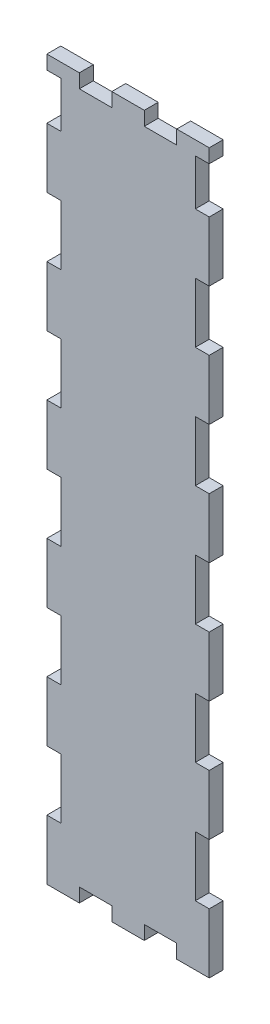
from build123d import *

# Parameters (mm, degrees)
BOSS_EXTRUDE1_DEPTH     = 3
CUT_EXTRUDE4_DEPTH      = 18
CUT_EXTRUDE4_DEPTH_BACK = 41
SKETCH3_W               = 3
SKETCH3_H               = 9.916666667
SKETCH3_H_2             = 12.916666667
SKETCH3_H_3             = 12.916666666


with BuildPart() as part:
    # Sketch1 → Boss-Extrude1 (new body)
    with BuildSketch(Plane.XY):
        Polygon((3.5, 74.5), (10.5, 74.5), (10.5, 77.5), (17.5, 77.5), (17.5, -77.5), (10.5, -77.5), (10.5, -74.5), (3.5, -74.5), (3.5, -77.5), (-3.5, -77.5), (-3.5, -74.5), (-10.5, -74.5), (-10.5, -77.5), (-17.5, -77.5), (-17.5, 77.5), (-10.5, 77.5), (-10.5, 74.5), (-3.5, 74.5), (-3.5, 77.5), (3.5, 77.5), align=None)
    extrude(amount=BOSS_EXTRUDE1_DEPTH)

    # Sketch3 → Cut-Extrude4 (cut, two sides: drawn at the far end of the back side and taken through both)
    with BuildSketch(Plane.XY.offset(-CUT_EXTRUDE4_DEPTH_BACK)):
        with Locations((-16, 69.541666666)):
            Rectangle(SKETCH3_W, SKETCH3_H)
        with Locations((-16, 45.208333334)):
            Rectangle(SKETCH3_W, SKETCH3_H_2)
        with Locations((-16, 19.375)):
            Rectangle(SKETCH3_W, SKETCH3_H_3)
        with Locations((-16, -6.458333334)):
            Rectangle(SKETCH3_W, SKETCH3_H_2)
        with Locations((-16, -32.291666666)):
            Rectangle(SKETCH3_W, SKETCH3_H_2)
        with Locations((-16, -58.125)):
            Rectangle(SKETCH3_W, SKETCH3_H_3)
        with Locations((16, -58.125)):
            Rectangle(SKETCH3_W, SKETCH3_H_3)
        with Locations((16, -32.291666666)):
            Rectangle(SKETCH3_W, SKETCH3_H_2)
        with Locations((16, -6.458333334)):
            Rectangle(SKETCH3_W, SKETCH3_H_2)
        with Locations((16, 19.375)):
            Rectangle(SKETCH3_W, SKETCH3_H_3)
        with Locations((16, 45.208333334)):
            Rectangle(SKETCH3_W, SKETCH3_H_2)
        with Locations((16, 69.541666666)):
            Rectangle(SKETCH3_W, SKETCH3_H)
    extrude(amount=CUT_EXTRUDE4_DEPTH + CUT_EXTRUDE4_DEPTH_BACK, mode=Mode.SUBTRACT)


solid = part.part
